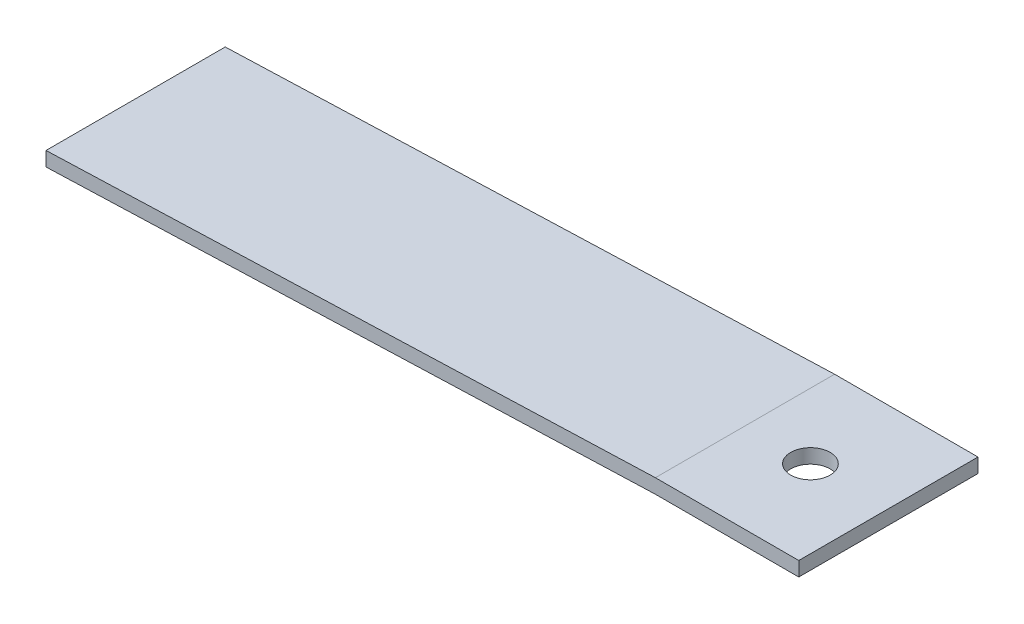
ISO-10303-21;
HEADER;
FILE_DESCRIPTION(('STEP AP214'),'2;1');
FILE_NAME('part.step','',(''),(''),'','','');
FILE_SCHEMA(('AUTOMOTIVE_DESIGN { 1 0 10303 214 1 1 1 1 }'));
ENDSEC;
DATA;
#1=APPLICATION_CONTEXT('core data for automotive mechanical design processes');
#2=APPLICATION_PROTOCOL_DEFINITION('international standard','automotive_design',2000,#1);
#3=PRODUCT_CONTEXT('',#1,'mechanical');
#4=PRODUCT('Part','Part','',(#3));
#5=PRODUCT_RELATED_PRODUCT_CATEGORY('part','',(#4));
#6=PRODUCT_DEFINITION_FORMATION('','',#4);
#7=PRODUCT_DEFINITION_CONTEXT('part definition',#1,'design');
#8=PRODUCT_DEFINITION('design','',#6,#7);
#9=PRODUCT_DEFINITION_SHAPE('','',#8);
#10=(LENGTH_UNIT() NAMED_UNIT(*) SI_UNIT(.MILLI.,.METRE.));
#11=(NAMED_UNIT(*) PLANE_ANGLE_UNIT() SI_UNIT($,.RADIAN.));
#12=(NAMED_UNIT(*) SI_UNIT($,.STERADIAN.) SOLID_ANGLE_UNIT());
#13=UNCERTAINTY_MEASURE_WITH_UNIT(LENGTH_MEASURE(1.E-05),#10,'distance_accuracy_value','');
#14=(GEOMETRIC_REPRESENTATION_CONTEXT(3) GLOBAL_UNCERTAINTY_ASSIGNED_CONTEXT((#13)) GLOBAL_UNIT_ASSIGNED_CONTEXT((#10,
#11,#12)) REPRESENTATION_CONTEXT('',''));
#15=CARTESIAN_POINT('',(0.,0.,0.));
#16=DIRECTION('',(0.,0.,1.));
#17=DIRECTION('',(1.,0.,0.));
#18=AXIS2_PLACEMENT_3D('',#15,#16,#17);
#19=CARTESIAN_POINT('',(0.,0.,5.));
#20=DIRECTION('',(0.,1.,0.));
#21=DIRECTION('',(0.,0.,1.));
#22=AXIS2_PLACEMENT_3D('',#19,#20,#21);
#23=PLANE('',#22);
#24=CARTESIAN_POINT('',(3.65,0.,0.));
#25=DIRECTION('',(0.,1.,0.));
#26=DIRECTION('',(0.,0.,1.));
#27=AXIS2_PLACEMENT_3D('',#24,#25,#26);
#28=CIRCLE('',#27,1.1);
#29=CARTESIAN_POINT('',(3.65,0.,1.1));
#30=VERTEX_POINT('',#29);
#31=EDGE_CURVE('E132',#30,#30,#28,.T.);
#32=ORIENTED_EDGE('',*,*,#31,.T.);
#33=EDGE_LOOP('',(#32));
#34=FACE_BOUND('',#33,.T.);
#35=DIRECTION('',(1.,0.,0.));
#36=VECTOR('',#35,1.);
#37=CARTESIAN_POINT('',(0.,0.,-5.));
#38=LINE('',#37,#36);
#39=CARTESIAN_POINT('',(0.,0.,-5.));
#40=VERTEX_POINT('',#39);
#41=CARTESIAN_POINT('',(8.,0.,-5.));
#42=VERTEX_POINT('',#41);
#43=EDGE_CURVE('E128',#40,#42,#38,.T.);
#44=ORIENTED_EDGE('',*,*,#43,.T.);
#45=DIRECTION('',(0.,0.,-1.));
#46=VECTOR('',#45,1.);
#47=CARTESIAN_POINT('',(8.,0.,5.));
#48=LINE('',#47,#46);
#49=CARTESIAN_POINT('',(8.,0.,5.));
#50=VERTEX_POINT('',#49);
#51=EDGE_CURVE('E13',#50,#42,#48,.T.);
#52=ORIENTED_EDGE('',*,*,#51,.F.);
#53=DIRECTION('',(1.,0.,0.));
#54=VECTOR('',#53,1.);
#55=CARTESIAN_POINT('',(0.,0.,5.));
#56=LINE('',#55,#54);
#57=CARTESIAN_POINT('',(0.,0.,5.));
#58=VERTEX_POINT('',#57);
#59=EDGE_CURVE('E139',#58,#50,#56,.T.);
#60=ORIENTED_EDGE('',*,*,#59,.F.);
#61=DIRECTION('',(0.,0.,-1.));
#62=VECTOR('',#61,1.);
#63=CARTESIAN_POINT('',(0.,0.,5.));
#64=LINE('',#63,#62);
#65=EDGE_CURVE('E124',#58,#40,#64,.T.);
#66=ORIENTED_EDGE('',*,*,#65,.T.);
#67=EDGE_LOOP('',(#44,#52,#60,#66));
#68=FACE_BOUND('',#67,.T.);
#69=ADVANCED_FACE('F44',(#34,#68),#23,.F.);
#70=CARTESIAN_POINT('',(8.,0.,5.));
#71=DIRECTION('',(-1.,0.,0.));
#72=DIRECTION('',(0.,0.,1.));
#73=AXIS2_PLACEMENT_3D('',#70,#71,#72);
#74=PLANE('',#73);
#75=DIRECTION('',(0.,1.,0.));
#76=VECTOR('',#75,1.);
#77=CARTESIAN_POINT('',(8.,0.,-5.));
#78=LINE('',#77,#76);
#79=CARTESIAN_POINT('',(8.,0.8,-5.));
#80=VERTEX_POINT('',#79);
#81=EDGE_CURVE('E131',#42,#80,#78,.T.);
#82=ORIENTED_EDGE('',*,*,#81,.T.);
#83=DIRECTION('',(0.,0.,-1.));
#84=VECTOR('',#83,1.);
#85=CARTESIAN_POINT('',(8.,0.8,5.));
#86=LINE('',#85,#84);
#87=CARTESIAN_POINT('',(8.,0.8,5.));
#88=VERTEX_POINT('',#87);
#89=EDGE_CURVE('E52',#88,#80,#86,.T.);
#90=ORIENTED_EDGE('',*,*,#89,.F.);
#91=DIRECTION('',(0.,1.,0.));
#92=VECTOR('',#91,1.);
#93=CARTESIAN_POINT('',(8.,0.,5.));
#94=LINE('',#93,#92);
#95=EDGE_CURVE('E97',#50,#88,#94,.T.);
#96=ORIENTED_EDGE('',*,*,#95,.F.);
#97=ORIENTED_EDGE('',*,*,#51,.T.);
#98=EDGE_LOOP('',(#82,#90,#96,#97));
#99=FACE_BOUND('',#98,.T.);
#100=ADVANCED_FACE('F163',(#99),#74,.F.);
#101=CARTESIAN_POINT('',(0.,0.8,5.));
#102=DIRECTION('',(0.,-1.,0.));
#103=DIRECTION('',(0.,0.,-1.));
#104=AXIS2_PLACEMENT_3D('',#101,#102,#103);
#105=PLANE('',#104);
#106=CARTESIAN_POINT('',(3.65,0.8,0.));
#107=DIRECTION('',(0.,1.,0.));
#108=DIRECTION('',(0.,0.,1.));
#109=AXIS2_PLACEMENT_3D('',#106,#107,#108);
#110=CIRCLE('',#109,1.1);
#111=CARTESIAN_POINT('',(3.65,0.8,1.1));
#112=VERTEX_POINT('',#111);
#113=EDGE_CURVE('E171',#112,#112,#110,.T.);
#114=ORIENTED_EDGE('',*,*,#113,.F.);
#115=EDGE_LOOP('',(#114));
#116=FACE_BOUND('',#115,.T.);
#117=DIRECTION('',(-1.,0.,0.));
#118=VECTOR('',#117,1.);
#119=CARTESIAN_POINT('',(0.,0.8,-5.));
#120=LINE('',#119,#118);
#121=CARTESIAN_POINT('',(0.,0.8,-5.));
#122=VERTEX_POINT('',#121);
#123=EDGE_CURVE('E134',#80,#122,#120,.T.);
#124=ORIENTED_EDGE('',*,*,#123,.T.);
#125=DIRECTION('',(0.,0.,-1.));
#126=VECTOR('',#125,1.);
#127=CARTESIAN_POINT('',(0.,0.8,5.));
#128=LINE('',#127,#126);
#129=CARTESIAN_POINT('',(0.,0.8,5.));
#130=VERTEX_POINT('',#129);
#131=EDGE_CURVE('E119',#130,#122,#128,.T.);
#132=ORIENTED_EDGE('',*,*,#131,.F.);
#133=DIRECTION('',(-1.,0.,0.));
#134=VECTOR('',#133,1.);
#135=CARTESIAN_POINT('',(0.,0.8,5.));
#136=LINE('',#135,#134);
#137=EDGE_CURVE('E110',#88,#130,#136,.T.);
#138=ORIENTED_EDGE('',*,*,#137,.F.);
#139=ORIENTED_EDGE('',*,*,#89,.T.);
#140=EDGE_LOOP('',(#124,#132,#138,#139));
#141=FACE_BOUND('',#140,.T.);
#142=ADVANCED_FACE('F145',(#116,#141),#105,.F.);
#143=CARTESIAN_POINT('',(-34.,-0.387306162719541,5.));
#144=DIRECTION('',(0.0348994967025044,-0.999390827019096,0.));
#145=DIRECTION('',(0.999390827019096,0.0348994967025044,0.));
#146=AXIS2_PLACEMENT_3D('',#143,#144,#145);
#147=PLANE('',#146);
#148=DIRECTION('',(-0.999390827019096,-0.0348994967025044,0.));
#149=VECTOR('',#148,1.);
#150=CARTESIAN_POINT('',(-34.,-0.387306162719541,-5.));
#151=LINE('',#150,#149);
#152=CARTESIAN_POINT('',(-34.,-0.387306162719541,-5.));
#153=VERTEX_POINT('',#152);
#154=EDGE_CURVE('E118',#122,#153,#151,.T.);
#155=ORIENTED_EDGE('',*,*,#154,.T.);
#156=DIRECTION('',(0.,0.,-1.));
#157=VECTOR('',#156,1.);
#158=CARTESIAN_POINT('',(-34.,-0.387306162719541,5.));
#159=LINE('',#158,#157);
#160=CARTESIAN_POINT('',(-34.,-0.387306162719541,5.));
#161=VERTEX_POINT('',#160);
#162=EDGE_CURVE('E115',#161,#153,#159,.T.);
#163=ORIENTED_EDGE('',*,*,#162,.F.);
#164=DIRECTION('',(-0.999390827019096,-0.0348994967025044,0.));
#165=VECTOR('',#164,1.);
#166=CARTESIAN_POINT('',(-34.,-0.387306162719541,5.));
#167=LINE('',#166,#165);
#168=EDGE_CURVE('E104',#130,#161,#167,.T.);
#169=ORIENTED_EDGE('',*,*,#168,.F.);
#170=ORIENTED_EDGE('',*,*,#131,.T.);
#171=EDGE_LOOP('',(#155,#163,#169,#170));
#172=FACE_BOUND('',#171,.T.);
#173=ADVANCED_FACE('F116',(#172),#147,.F.);
#174=CARTESIAN_POINT('',(-34.,-1.18730616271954,5.));
#175=DIRECTION('',(1.,0.,0.));
#176=DIRECTION('',(0.,0.,-1.));
#177=AXIS2_PLACEMENT_3D('',#174,#175,#176);
#178=PLANE('',#177);
#179=DIRECTION('',(0.,-1.,0.));
#180=VECTOR('',#179,1.);
#181=CARTESIAN_POINT('',(-34.,-1.18730616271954,-5.));
#182=LINE('',#181,#180);
#183=CARTESIAN_POINT('',(-34.,-1.18730616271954,-5.));
#184=VERTEX_POINT('',#183);
#185=EDGE_CURVE('E83',#153,#184,#182,.T.);
#186=ORIENTED_EDGE('',*,*,#185,.T.);
#187=DIRECTION('',(0.,0.,-1.));
#188=VECTOR('',#187,1.);
#189=CARTESIAN_POINT('',(-34.,-1.18730616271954,5.));
#190=LINE('',#189,#188);
#191=CARTESIAN_POINT('',(-34.,-1.18730616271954,5.));
#192=VERTEX_POINT('',#191);
#193=EDGE_CURVE('E120',#192,#184,#190,.T.);
#194=ORIENTED_EDGE('',*,*,#193,.F.);
#195=DIRECTION('',(0.,-1.,0.));
#196=VECTOR('',#195,1.);
#197=CARTESIAN_POINT('',(-34.,-1.18730616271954,5.));
#198=LINE('',#197,#196);
#199=EDGE_CURVE('E108',#161,#192,#198,.T.);
#200=ORIENTED_EDGE('',*,*,#199,.F.);
#201=ORIENTED_EDGE('',*,*,#162,.T.);
#202=EDGE_LOOP('',(#186,#194,#200,#201));
#203=FACE_BOUND('',#202,.T.);
#204=ADVANCED_FACE('F122',(#203),#178,.F.);
#205=CARTESIAN_POINT('',(0.,0.,5.));
#206=DIRECTION('',(-0.0348994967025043,0.999390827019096,0.));
#207=DIRECTION('',(-0.999390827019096,-0.0348994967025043,0.));
#208=AXIS2_PLACEMENT_3D('',#205,#206,#207);
#209=PLANE('',#208);
#210=DIRECTION('',(0.999390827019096,0.0348994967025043,0.));
#211=VECTOR('',#210,1.);
#212=CARTESIAN_POINT('',(0.,0.,-5.));
#213=LINE('',#212,#211);
#214=EDGE_CURVE('E89',#184,#40,#213,.T.);
#215=ORIENTED_EDGE('',*,*,#214,.T.);
#216=ORIENTED_EDGE('',*,*,#65,.F.);
#217=DIRECTION('',(0.999390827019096,0.0348994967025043,0.));
#218=VECTOR('',#217,1.);
#219=CARTESIAN_POINT('',(0.,0.,5.));
#220=LINE('',#219,#218);
#221=EDGE_CURVE('E60',#192,#58,#220,.T.);
#222=ORIENTED_EDGE('',*,*,#221,.F.);
#223=ORIENTED_EDGE('',*,*,#193,.T.);
#224=EDGE_LOOP('',(#215,#216,#222,#223));
#225=FACE_BOUND('',#224,.T.);
#226=ADVANCED_FACE('F152',(#225),#209,.F.);
#227=CARTESIAN_POINT('',(0.,0.,5.));
#228=DIRECTION('',(0.,0.,1.));
#229=DIRECTION('',(1.,0.,0.));
#230=AXIS2_PLACEMENT_3D('',#227,#228,#229);
#231=PLANE('',#230);
#232=ORIENTED_EDGE('',*,*,#59,.T.);
#233=ORIENTED_EDGE('',*,*,#95,.T.);
#234=ORIENTED_EDGE('',*,*,#137,.T.);
#235=ORIENTED_EDGE('',*,*,#168,.T.);
#236=ORIENTED_EDGE('',*,*,#199,.T.);
#237=ORIENTED_EDGE('',*,*,#221,.T.);
#238=EDGE_LOOP('',(#232,#233,#234,#235,#236,#237));
#239=FACE_BOUND('',#238,.T.);
#240=ADVANCED_FACE('F106',(#239),#231,.T.);
#241=CARTESIAN_POINT('',(0.,0.,-5.));
#242=DIRECTION('',(0.,0.,1.));
#243=DIRECTION('',(1.,0.,0.));
#244=AXIS2_PLACEMENT_3D('',#241,#242,#243);
#245=PLANE('',#244);
#246=ORIENTED_EDGE('',*,*,#43,.F.);
#247=ORIENTED_EDGE('',*,*,#214,.F.);
#248=ORIENTED_EDGE('',*,*,#185,.F.);
#249=ORIENTED_EDGE('',*,*,#154,.F.);
#250=ORIENTED_EDGE('',*,*,#123,.F.);
#251=ORIENTED_EDGE('',*,*,#81,.F.);
#252=EDGE_LOOP('',(#246,#247,#248,#249,#250,#251));
#253=FACE_BOUND('',#252,.T.);
#254=ADVANCED_FACE('F148',(#253),#245,.F.);
#255=CARTESIAN_POINT('',(3.65,-9.2,0.));
#256=DIRECTION('',(0.,1.,0.));
#257=DIRECTION('',(0.,0.,1.));
#258=AXIS2_PLACEMENT_3D('',#255,#256,#257);
#259=CYLINDRICAL_SURFACE('',#258,1.1);
#260=ORIENTED_EDGE('',*,*,#113,.T.);
#261=EDGE_LOOP('',(#260));
#262=FACE_BOUND('',#261,.T.);
#263=ORIENTED_EDGE('',*,*,#31,.F.);
#264=EDGE_LOOP('',(#263));
#265=FACE_BOUND('',#264,.T.);
#266=ADVANCED_FACE('F179',(#262,#265),#259,.F.);
#267=CLOSED_SHELL('',(#69,#100,#142,#173,#204,#226,#240,#254,#266));
#268=MANIFOLD_SOLID_BREP('B2',#267);
#269=ADVANCED_BREP_SHAPE_REPRESENTATION('',(#18,#268),#14);
#270=SHAPE_DEFINITION_REPRESENTATION(#9,#269);
ENDSEC;
END-ISO-10303-21;
